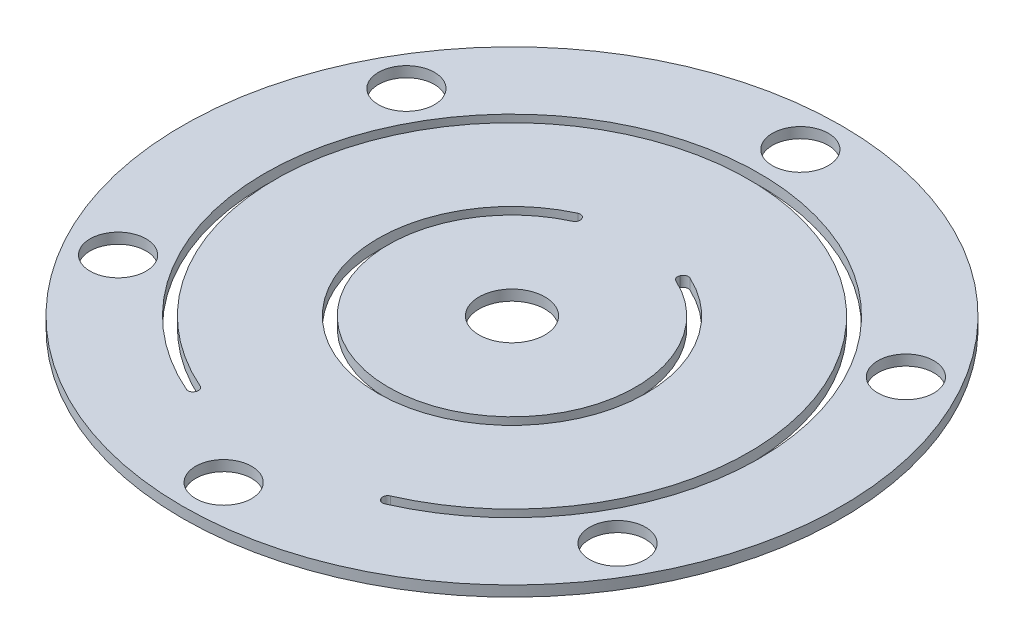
from build123d import *

# Parameters (mm, degrees)
SKETCH1_R                                = 25.4
BOSS_EXTRUDE1_DEPTH                      = 0.8128
SKETCH2_R                                = 2.159
F_6X_6_CLEARANCE_HOLE_DEPTH              = 36.93021909
CIRPATTERN1_COUNT                        = 6
SKETCH3_R                                = 2.54
CENTER_10_CLEARANCE_HOLE_CLOSE_FIT_DEPTH = 36.93021909
CUT_INSIDE_C_DEPTH                       = 36.93021909
FILLET1_R                                = 0.381
CUT_OUTSIDE_C_DEPTH                      = 36.93021909
FILLET3_R                                = 0.381


with BuildPart() as part:
    # Sketch1 → Boss-Extrude1 (new body)
    with BuildSketch(Plane(origin=(0, 0, 0), x_dir=(1, 0, 0), z_dir=(0, 1, 0))):
        with Locations(Location((0, 0, 0), (0, 0, 270))):
            Circle(SKETCH1_R)
    extrude(amount=BOSS_EXTRUDE1_DEPTH)

    # Sketch2 → 6x_6 clearance hole (cut, through all)
    with BuildSketch(Plane(origin=(0, 0.8128, 0), x_dir=(1, 0, 0), z_dir=(0, 1, 0))):
        with Locations(Location((0, 22.225, 0), (0, 0, 270))):
            Circle(SKETCH2_R)
    f_6x_6_clearance_hole = extrude(amount=-F_6X_6_CLEARANCE_HOLE_DEPTH, mode=Mode.SUBTRACT)

    # CirPattern1: 6x_6 clearance hole ×6 about axis
    cirpattern1_axis = Axis((0, 0, 0), (0, 1, 0))
    for i in range(1, CIRPATTERN1_COUNT):
        add(f_6x_6_clearance_hole.rotate(cirpattern1_axis, i * 360 / CIRPATTERN1_COUNT), mode=Mode.SUBTRACT)

    # Sketch3 → Center _10 Clearance hole close fit (cut, through all)
    with BuildSketch(Plane(origin=(0, 0.8128, 0), x_dir=(1, 0, 0), z_dir=(0, 1, 0))):
        with Locations(Location((0, 0, 0), (0, 0, 270))):
            Circle(SKETCH3_R)
    extrude(amount=-CENTER_10_CLEARANCE_HOLE_CLOSE_FIT_DEPTH, mode=Mode.SUBTRACT)

    # Sketch7 → Cut Inside C (cut, through all)
    with BuildSketch(Plane(origin=(0, 0.8128, 0), x_dir=(1, 0, 0), z_dir=(0, 1, 0))):
        with BuildLine():
            Line((-3.956104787, 9.550881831), (-3.645059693, 8.799952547))
            ThreePointArc((-3.645059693, 8.799952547), (0, -9.525), (3.645059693, 8.799952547))
            Line((3.645059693, 8.799952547), (3.956104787, 9.550881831))
            ThreePointArc((3.956104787, 9.550881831), (0, -10.3378), (-3.956104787, 9.550881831))
        make_face()
    extrude(amount=-CUT_INSIDE_C_DEPTH, mode=Mode.SUBTRACT)

    # Fillet1
    fillet1_edges = [part.edges().sort_by_distance(p)[0] for p in [
        (3.956104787, 0.4064, -9.550881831),
        (-3.956104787, 0.4064, -9.550881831),
        (-3.645059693, 0.4064, -8.799952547),
        (3.645059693, 0.4064, -8.799952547),
    ]]
    fillet(fillet1_edges, radius=FILLET1_R)

    # Sketch8 → Cut Outside C (cut, through all)
    with BuildSketch(Plane(origin=(0, 0.8128, 0), x_dir=(1, 0, 0), z_dir=(0, 1, 0))):
        with BuildLine():
            Line((-7.290119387, -17.599905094), (-6.979074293, -16.84897581))
            ThreePointArc((-6.979074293, -16.84897581), (0, 18.2372), (6.979074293, -16.84897581))
            Line((6.979074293, -16.84897581), (7.290119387, -17.599905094))
            ThreePointArc((7.290119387, -17.599905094), (0, 19.05), (-7.290119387, -17.599905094))
        make_face()
    extrude(amount=-CUT_OUTSIDE_C_DEPTH, mode=Mode.SUBTRACT)

    # Fillet3
    fillet3_edges = [part.edges().sort_by_distance(p)[0] for p in [
        (-7.290119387, 0.4064, 17.599905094),
        (7.290119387, 0.4064, 17.599905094),
        (6.979074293, 0.4064, 16.84897581),
        (-6.979074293, 0.4064, 16.84897581),
    ]]
    fillet(fillet3_edges, radius=FILLET3_R)


solid = part.part
